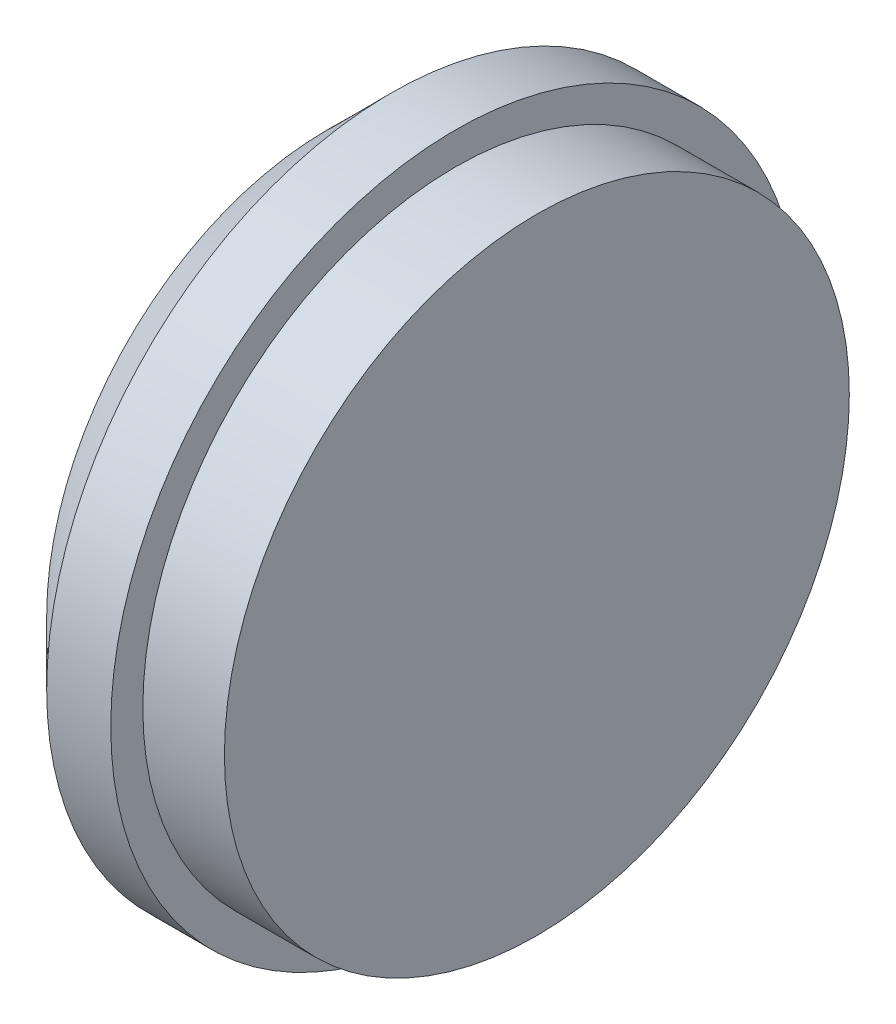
ISO-10303-21;
HEADER;
FILE_DESCRIPTION(('STEP AP214'),'2;1');
FILE_NAME('part.step','',(''),(''),'','','');
FILE_SCHEMA(('AUTOMOTIVE_DESIGN { 1 0 10303 214 1 1 1 1 }'));
ENDSEC;
DATA;
#1=APPLICATION_CONTEXT('core data for automotive mechanical design processes');
#2=APPLICATION_PROTOCOL_DEFINITION('international standard','automotive_design',2000,#1);
#3=PRODUCT_CONTEXT('',#1,'mechanical');
#4=PRODUCT('Part','Part','',(#3));
#5=PRODUCT_RELATED_PRODUCT_CATEGORY('part','',(#4));
#6=PRODUCT_DEFINITION_FORMATION('','',#4);
#7=PRODUCT_DEFINITION_CONTEXT('part definition',#1,'design');
#8=PRODUCT_DEFINITION('design','',#6,#7);
#9=PRODUCT_DEFINITION_SHAPE('','',#8);
#10=(LENGTH_UNIT() NAMED_UNIT(*) SI_UNIT(.MILLI.,.METRE.));
#11=(NAMED_UNIT(*) PLANE_ANGLE_UNIT() SI_UNIT($,.RADIAN.));
#12=(NAMED_UNIT(*) SI_UNIT($,.STERADIAN.) SOLID_ANGLE_UNIT());
#13=UNCERTAINTY_MEASURE_WITH_UNIT(LENGTH_MEASURE(1.E-05),#10,'distance_accuracy_value','');
#14=(GEOMETRIC_REPRESENTATION_CONTEXT(3) GLOBAL_UNCERTAINTY_ASSIGNED_CONTEXT((#13)) GLOBAL_UNIT_ASSIGNED_CONTEXT((#10,
#11,#12)) REPRESENTATION_CONTEXT('',''));
#15=CARTESIAN_POINT('',(0.,0.,0.));
#16=DIRECTION('',(0.,0.,1.));
#17=DIRECTION('',(1.,0.,0.));
#18=AXIS2_PLACEMENT_3D('',#15,#16,#17);
#19=CARTESIAN_POINT('',(-6.34745999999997,17.8282600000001,0.));
#20=DIRECTION('',(1.,0.,0.));
#21=DIRECTION('',(0.,0.,-1.));
#22=AXIS2_PLACEMENT_3D('',#19,#20,#21);
#23=PLANE('',#22);
#24=CARTESIAN_POINT('',(-6.34745999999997,17.8282600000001,0.));
#25=DIRECTION('',(-1.,0.,0.));
#26=DIRECTION('',(0.,0.,1.));
#27=AXIS2_PLACEMENT_3D('',#24,#25,#26);
#28=CIRCLE('',#27,21.2852);
#29=CARTESIAN_POINT('',(-6.34745999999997,17.8282600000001,21.2852));
#30=VERTEX_POINT('',#29);
#31=EDGE_CURVE('E10',#30,#30,#28,.T.);
#32=ORIENTED_EDGE('',*,*,#31,.F.);
#33=EDGE_LOOP('',(#32));
#34=FACE_BOUND('',#33,.T.);
#35=ADVANCED_FACE('F31',(#34),#23,.T.);
#36=CARTESIAN_POINT('',(-20.63496,17.8282600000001,0.));
#37=DIRECTION('',(-1.,0.,0.));
#38=DIRECTION('',(0.,0.,1.));
#39=AXIS2_PLACEMENT_3D('',#36,#37,#38);
#40=CYLINDRICAL_SURFACE('',#39,21.2852);
#41=ORIENTED_EDGE('',*,*,#31,.T.);
#42=EDGE_LOOP('',(#41));
#43=FACE_BOUND('',#42,.T.);
#44=CARTESIAN_POINT('',(-11.90498,17.8282600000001,0.));
#45=DIRECTION('',(-1.,0.,0.));
#46=DIRECTION('',(0.,0.,1.));
#47=AXIS2_PLACEMENT_3D('',#44,#45,#46);
#48=CIRCLE('',#47,21.2852);
#49=CARTESIAN_POINT('',(-11.90498,17.8282600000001,21.2852));
#50=VERTEX_POINT('',#49);
#51=EDGE_CURVE('E37',#50,#50,#48,.T.);
#52=ORIENTED_EDGE('',*,*,#51,.F.);
#53=EDGE_LOOP('',(#52));
#54=FACE_BOUND('',#53,.T.);
#55=ADVANCED_FACE('F70',(#43,#54),#40,.T.);
#56=CARTESIAN_POINT('',(-11.90498,-3.45693999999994,0.));
#57=DIRECTION('',(1.,0.,0.));
#58=DIRECTION('',(0.,0.,-1.));
#59=AXIS2_PLACEMENT_3D('',#56,#57,#58);
#60=PLANE('',#59);
#61=ORIENTED_EDGE('',*,*,#51,.T.);
#62=EDGE_LOOP('',(#61));
#63=FACE_BOUND('',#62,.T.);
#64=CARTESIAN_POINT('',(-11.90498,17.8282600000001,0.));
#65=DIRECTION('',(-1.,0.,0.));
#66=DIRECTION('',(0.,0.,1.));
#67=AXIS2_PLACEMENT_3D('',#64,#65,#66);
#68=CIRCLE('',#67,23.4696);
#69=CARTESIAN_POINT('',(-11.90498,17.8282600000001,23.4696));
#70=VERTEX_POINT('',#69);
#71=EDGE_CURVE('E41',#70,#70,#68,.T.);
#72=ORIENTED_EDGE('',*,*,#71,.F.);
#73=EDGE_LOOP('',(#72));
#74=FACE_BOUND('',#73,.T.);
#75=ADVANCED_FACE('F66',(#63,#74),#60,.T.);
#76=CARTESIAN_POINT('',(-20.63496,17.8282600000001,0.));
#77=DIRECTION('',(-1.,0.,0.));
#78=DIRECTION('',(0.,0.,1.));
#79=AXIS2_PLACEMENT_3D('',#76,#77,#78);
#80=CYLINDRICAL_SURFACE('',#79,23.4696);
#81=ORIENTED_EDGE('',*,*,#71,.T.);
#82=EDGE_LOOP('',(#81));
#83=FACE_BOUND('',#82,.T.);
#84=CARTESIAN_POINT('',(-16.27124,17.8282600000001,0.));
#85=DIRECTION('',(-1.,0.,0.));
#86=DIRECTION('',(0.,0.,1.));
#87=AXIS2_PLACEMENT_3D('',#84,#85,#86);
#88=CIRCLE('',#87,23.4696);
#89=CARTESIAN_POINT('',(-16.27124,17.8282600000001,23.4696));
#90=VERTEX_POINT('',#89);
#91=EDGE_CURVE('E45',#90,#90,#88,.T.);
#92=ORIENTED_EDGE('',*,*,#91,.F.);
#93=EDGE_LOOP('',(#92));
#94=FACE_BOUND('',#93,.T.);
#95=ADVANCED_FACE('F58',(#83,#94),#80,.T.);
#96=CARTESIAN_POINT('',(-20.63496,17.8282600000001,0.));
#97=DIRECTION('',(1.,0.,0.));
#98=DIRECTION('',(0.,0.,-1.));
#99=AXIS2_PLACEMENT_3D('',#96,#97,#98);
#100=CONICAL_SURFACE('',#99,19.10588,0.785398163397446);
#101=ORIENTED_EDGE('',*,*,#91,.T.);
#102=EDGE_LOOP('',(#101));
#103=FACE_BOUND('',#102,.T.);
#104=CARTESIAN_POINT('',(-20.63496,17.8282600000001,0.));
#105=DIRECTION('',(-1.,0.,0.));
#106=DIRECTION('',(0.,0.,1.));
#107=AXIS2_PLACEMENT_3D('',#104,#105,#106);
#108=CIRCLE('',#107,19.10588);
#109=CARTESIAN_POINT('',(-20.63496,17.8282600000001,19.10588));
#110=VERTEX_POINT('',#109);
#111=EDGE_CURVE('E50',#110,#110,#108,.T.);
#112=ORIENTED_EDGE('',*,*,#111,.F.);
#113=EDGE_LOOP('',(#112));
#114=FACE_BOUND('',#113,.T.);
#115=ADVANCED_FACE('F56',(#103,#114),#100,.T.);
#116=CARTESIAN_POINT('',(-20.63496,-1.27761999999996,0.));
#117=DIRECTION('',(-1.,0.,0.));
#118=DIRECTION('',(0.,0.,1.));
#119=AXIS2_PLACEMENT_3D('',#116,#117,#118);
#120=PLANE('',#119);
#121=ORIENTED_EDGE('',*,*,#111,.T.);
#122=EDGE_LOOP('',(#121));
#123=FACE_BOUND('',#122,.T.);
#124=ADVANCED_FACE('F54',(#123),#120,.T.);
#125=CLOSED_SHELL('',(#35,#55,#75,#95,#115,#124));
#126=MANIFOLD_SOLID_BREP('B2',#125);
#127=ADVANCED_BREP_SHAPE_REPRESENTATION('',(#18,#126),#14);
#128=SHAPE_DEFINITION_REPRESENTATION(#9,#127);
ENDSEC;
END-ISO-10303-21;
